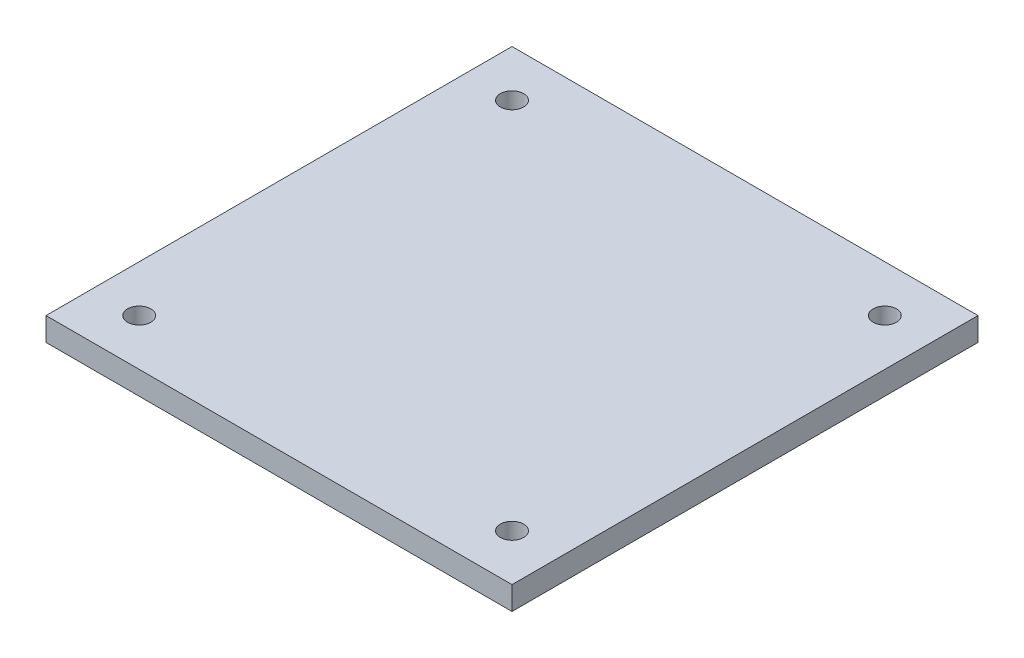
ISO-10303-21;
HEADER;
FILE_DESCRIPTION(('STEP AP214'),'2;1');
FILE_NAME('part.step','',(''),(''),'','','');
FILE_SCHEMA(('AUTOMOTIVE_DESIGN { 1 0 10303 214 1 1 1 1 }'));
ENDSEC;
DATA;
#1=APPLICATION_CONTEXT('core data for automotive mechanical design processes');
#2=APPLICATION_PROTOCOL_DEFINITION('international standard','automotive_design',2000,#1);
#3=PRODUCT_CONTEXT('',#1,'mechanical');
#4=PRODUCT('Part','Part','',(#3));
#5=PRODUCT_RELATED_PRODUCT_CATEGORY('part','',(#4));
#6=PRODUCT_DEFINITION_FORMATION('','',#4);
#7=PRODUCT_DEFINITION_CONTEXT('part definition',#1,'design');
#8=PRODUCT_DEFINITION('design','',#6,#7);
#9=PRODUCT_DEFINITION_SHAPE('','',#8);
#10=(LENGTH_UNIT() NAMED_UNIT(*) SI_UNIT(.MILLI.,.METRE.));
#11=(NAMED_UNIT(*) PLANE_ANGLE_UNIT() SI_UNIT($,.RADIAN.));
#12=(NAMED_UNIT(*) SI_UNIT($,.STERADIAN.) SOLID_ANGLE_UNIT());
#13=UNCERTAINTY_MEASURE_WITH_UNIT(LENGTH_MEASURE(1.E-05),#10,'distance_accuracy_value','');
#14=(GEOMETRIC_REPRESENTATION_CONTEXT(3) GLOBAL_UNCERTAINTY_ASSIGNED_CONTEXT((#13)) GLOBAL_UNIT_ASSIGNED_CONTEXT((#10,
#11,#12)) REPRESENTATION_CONTEXT('',''));
#15=CARTESIAN_POINT('',(0.,0.,0.));
#16=DIRECTION('',(0.,0.,1.));
#17=DIRECTION('',(1.,0.,0.));
#18=AXIS2_PLACEMENT_3D('',#15,#16,#17);
#19=CARTESIAN_POINT('',(50.,5.,-50.));
#20=DIRECTION('',(-1.,0.,0.));
#21=DIRECTION('',(0.,0.,1.));
#22=AXIS2_PLACEMENT_3D('',#19,#20,#21);
#23=PLANE('',#22);
#24=DIRECTION('',(0.,0.,-1.));
#25=VECTOR('',#24,1.);
#26=CARTESIAN_POINT('',(50.,0.,-50.));
#27=LINE('',#26,#25);
#28=CARTESIAN_POINT('',(50.,0.,50.));
#29=VERTEX_POINT('',#28);
#30=CARTESIAN_POINT('',(50.,0.,-50.));
#31=VERTEX_POINT('',#30);
#32=EDGE_CURVE('E99',#29,#31,#27,.T.);
#33=ORIENTED_EDGE('',*,*,#32,.T.);
#34=DIRECTION('',(0.,-1.,0.));
#35=VECTOR('',#34,1.);
#36=CARTESIAN_POINT('',(50.,5.,-50.));
#37=LINE('',#36,#35);
#38=CARTESIAN_POINT('',(50.,5.,-50.));
#39=VERTEX_POINT('',#38);
#40=EDGE_CURVE('E11',#39,#31,#37,.T.);
#41=ORIENTED_EDGE('',*,*,#40,.F.);
#42=DIRECTION('',(0.,0.,-1.));
#43=VECTOR('',#42,1.);
#44=CARTESIAN_POINT('',(50.,5.,-50.));
#45=LINE('',#44,#43);
#46=CARTESIAN_POINT('',(50.,5.,50.));
#47=VERTEX_POINT('',#46);
#48=EDGE_CURVE('E87',#47,#39,#45,.T.);
#49=ORIENTED_EDGE('',*,*,#48,.F.);
#50=DIRECTION('',(0.,-1.,0.));
#51=VECTOR('',#50,1.);
#52=CARTESIAN_POINT('',(50.,5.,50.));
#53=LINE('',#52,#51);
#54=EDGE_CURVE('E95',#47,#29,#53,.T.);
#55=ORIENTED_EDGE('',*,*,#54,.T.);
#56=EDGE_LOOP('',(#33,#41,#49,#55));
#57=FACE_BOUND('',#56,.T.);
#58=ADVANCED_FACE('F36',(#57),#23,.F.);
#59=CARTESIAN_POINT('',(-50.,5.,-50.));
#60=DIRECTION('',(0.,0.,1.));
#61=DIRECTION('',(1.,0.,0.));
#62=AXIS2_PLACEMENT_3D('',#59,#60,#61);
#63=PLANE('',#62);
#64=DIRECTION('',(-1.,0.,0.));
#65=VECTOR('',#64,1.);
#66=CARTESIAN_POINT('',(-50.,0.,-50.));
#67=LINE('',#66,#65);
#68=CARTESIAN_POINT('',(-50.,0.,-50.));
#69=VERTEX_POINT('',#68);
#70=EDGE_CURVE('E91',#31,#69,#67,.T.);
#71=ORIENTED_EDGE('',*,*,#70,.T.);
#72=DIRECTION('',(0.,-1.,0.));
#73=VECTOR('',#72,1.);
#74=CARTESIAN_POINT('',(-50.,5.,-50.));
#75=LINE('',#74,#73);
#76=CARTESIAN_POINT('',(-50.,5.,-50.));
#77=VERTEX_POINT('',#76);
#78=EDGE_CURVE('E44',#77,#69,#75,.T.);
#79=ORIENTED_EDGE('',*,*,#78,.F.);
#80=DIRECTION('',(-1.,0.,0.));
#81=VECTOR('',#80,1.);
#82=CARTESIAN_POINT('',(-50.,5.,-50.));
#83=LINE('',#82,#81);
#84=EDGE_CURVE('E82',#39,#77,#83,.T.);
#85=ORIENTED_EDGE('',*,*,#84,.F.);
#86=ORIENTED_EDGE('',*,*,#40,.T.);
#87=EDGE_LOOP('',(#71,#79,#85,#86));
#88=FACE_BOUND('',#87,.T.);
#89=ADVANCED_FACE('F90',(#88),#63,.F.);
#90=CARTESIAN_POINT('',(-50.,5.,-50.));
#91=DIRECTION('',(1.,0.,0.));
#92=DIRECTION('',(0.,0.,-1.));
#93=AXIS2_PLACEMENT_3D('',#90,#91,#92);
#94=PLANE('',#93);
#95=DIRECTION('',(0.,0.,1.));
#96=VECTOR('',#95,1.);
#97=CARTESIAN_POINT('',(-50.,0.,-50.));
#98=LINE('',#97,#96);
#99=CARTESIAN_POINT('',(-50.,0.,50.));
#100=VERTEX_POINT('',#99);
#101=EDGE_CURVE('E69',#69,#100,#98,.T.);
#102=ORIENTED_EDGE('',*,*,#101,.T.);
#103=DIRECTION('',(0.,-1.,0.));
#104=VECTOR('',#103,1.);
#105=CARTESIAN_POINT('',(-50.,5.,50.));
#106=LINE('',#105,#104);
#107=CARTESIAN_POINT('',(-50.,5.,50.));
#108=VERTEX_POINT('',#107);
#109=EDGE_CURVE('E92',#108,#100,#106,.T.);
#110=ORIENTED_EDGE('',*,*,#109,.F.);
#111=DIRECTION('',(0.,0.,1.));
#112=VECTOR('',#111,1.);
#113=CARTESIAN_POINT('',(-50.,5.,-50.));
#114=LINE('',#113,#112);
#115=EDGE_CURVE('E85',#77,#108,#114,.T.);
#116=ORIENTED_EDGE('',*,*,#115,.F.);
#117=ORIENTED_EDGE('',*,*,#78,.T.);
#118=EDGE_LOOP('',(#102,#110,#116,#117));
#119=FACE_BOUND('',#118,.T.);
#120=ADVANCED_FACE('F93',(#119),#94,.F.);
#121=CARTESIAN_POINT('',(-50.,5.,50.));
#122=DIRECTION('',(0.,0.,-1.));
#123=DIRECTION('',(-1.,0.,0.));
#124=AXIS2_PLACEMENT_3D('',#121,#122,#123);
#125=PLANE('',#124);
#126=DIRECTION('',(1.,0.,0.));
#127=VECTOR('',#126,1.);
#128=CARTESIAN_POINT('',(-50.,0.,50.));
#129=LINE('',#128,#127);
#130=EDGE_CURVE('E75',#100,#29,#129,.T.);
#131=ORIENTED_EDGE('',*,*,#130,.T.);
#132=ORIENTED_EDGE('',*,*,#54,.F.);
#133=DIRECTION('',(1.,0.,0.));
#134=VECTOR('',#133,1.);
#135=CARTESIAN_POINT('',(-50.,5.,50.));
#136=LINE('',#135,#134);
#137=EDGE_CURVE('E52',#108,#47,#136,.T.);
#138=ORIENTED_EDGE('',*,*,#137,.F.);
#139=ORIENTED_EDGE('',*,*,#109,.T.);
#140=EDGE_LOOP('',(#131,#132,#138,#139));
#141=FACE_BOUND('',#140,.T.);
#142=ADVANCED_FACE('F107',(#141),#125,.F.);
#143=CARTESIAN_POINT('',(0.,5.,0.));
#144=DIRECTION('',(0.,1.,0.));
#145=DIRECTION('',(0.,0.,1.));
#146=AXIS2_PLACEMENT_3D('',#143,#144,#145);
#147=PLANE('',#146);
#148=CARTESIAN_POINT('',(-40.,5.,-40.));
#149=DIRECTION('',(0.,1.,0.));
#150=DIRECTION('',(0.,0.,1.));
#151=AXIS2_PLACEMENT_3D('',#148,#149,#150);
#152=CIRCLE('',#151,2.49999999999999);
#153=CARTESIAN_POINT('',(-40.,5.,-37.5));
#154=VERTEX_POINT('',#153);
#155=EDGE_CURVE('E142',#154,#154,#152,.T.);
#156=ORIENTED_EDGE('',*,*,#155,.F.);
#157=EDGE_LOOP('',(#156));
#158=FACE_BOUND('',#157,.T.);
#159=CARTESIAN_POINT('',(-40.,5.,40.));
#160=DIRECTION('',(0.,1.,0.));
#161=DIRECTION('',(0.,0.,1.));
#162=AXIS2_PLACEMENT_3D('',#159,#160,#161);
#163=CIRCLE('',#162,2.49999999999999);
#164=CARTESIAN_POINT('',(-40.,5.,42.5));
#165=VERTEX_POINT('',#164);
#166=EDGE_CURVE('E133',#165,#165,#163,.T.);
#167=ORIENTED_EDGE('',*,*,#166,.F.);
#168=EDGE_LOOP('',(#167));
#169=FACE_BOUND('',#168,.T.);
#170=CARTESIAN_POINT('',(40.,5.,-40.));
#171=DIRECTION('',(0.,1.,0.));
#172=DIRECTION('',(0.,0.,1.));
#173=AXIS2_PLACEMENT_3D('',#170,#171,#172);
#174=CIRCLE('',#173,2.49999999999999);
#175=CARTESIAN_POINT('',(40.,5.,-37.5));
#176=VERTEX_POINT('',#175);
#177=EDGE_CURVE('E124',#176,#176,#174,.T.);
#178=ORIENTED_EDGE('',*,*,#177,.F.);
#179=EDGE_LOOP('',(#178));
#180=FACE_BOUND('',#179,.T.);
#181=CARTESIAN_POINT('',(40.,5.,40.));
#182=DIRECTION('',(0.,1.,0.));
#183=DIRECTION('',(0.,0.,1.));
#184=AXIS2_PLACEMENT_3D('',#181,#182,#183);
#185=CIRCLE('',#184,2.49999999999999);
#186=CARTESIAN_POINT('',(40.,5.,42.5));
#187=VERTEX_POINT('',#186);
#188=EDGE_CURVE('E115',#187,#187,#185,.T.);
#189=ORIENTED_EDGE('',*,*,#188,.F.);
#190=EDGE_LOOP('',(#189));
#191=FACE_BOUND('',#190,.T.);
#192=ORIENTED_EDGE('',*,*,#48,.T.);
#193=ORIENTED_EDGE('',*,*,#84,.T.);
#194=ORIENTED_EDGE('',*,*,#115,.T.);
#195=ORIENTED_EDGE('',*,*,#137,.T.);
#196=EDGE_LOOP('',(#192,#193,#194,#195));
#197=FACE_BOUND('',#196,.T.);
#198=ADVANCED_FACE('F83',(#158,#169,#180,#191,#197),#147,.T.);
#199=CARTESIAN_POINT('',(0.,0.,0.));
#200=DIRECTION('',(0.,1.,0.));
#201=DIRECTION('',(0.,0.,1.));
#202=AXIS2_PLACEMENT_3D('',#199,#200,#201);
#203=PLANE('',#202);
#204=CARTESIAN_POINT('',(-40.,0.,-40.));
#205=DIRECTION('',(0.,1.,0.));
#206=DIRECTION('',(0.,0.,1.));
#207=AXIS2_PLACEMENT_3D('',#204,#205,#206);
#208=CIRCLE('',#207,2.525);
#209=CARTESIAN_POINT('',(-40.,0.,-37.475));
#210=VERTEX_POINT('',#209);
#211=EDGE_CURVE('E145',#210,#210,#208,.T.);
#212=ORIENTED_EDGE('',*,*,#211,.T.);
#213=EDGE_LOOP('',(#212));
#214=FACE_BOUND('',#213,.T.);
#215=CARTESIAN_POINT('',(-40.,0.,40.));
#216=DIRECTION('',(0.,1.,0.));
#217=DIRECTION('',(0.,0.,1.));
#218=AXIS2_PLACEMENT_3D('',#215,#216,#217);
#219=CIRCLE('',#218,2.525);
#220=CARTESIAN_POINT('',(-40.,0.,42.525));
#221=VERTEX_POINT('',#220);
#222=EDGE_CURVE('E136',#221,#221,#219,.T.);
#223=ORIENTED_EDGE('',*,*,#222,.T.);
#224=EDGE_LOOP('',(#223));
#225=FACE_BOUND('',#224,.T.);
#226=CARTESIAN_POINT('',(40.,0.,-40.));
#227=DIRECTION('',(0.,1.,0.));
#228=DIRECTION('',(0.,0.,1.));
#229=AXIS2_PLACEMENT_3D('',#226,#227,#228);
#230=CIRCLE('',#229,2.525);
#231=CARTESIAN_POINT('',(40.,0.,-37.475));
#232=VERTEX_POINT('',#231);
#233=EDGE_CURVE('E127',#232,#232,#230,.T.);
#234=ORIENTED_EDGE('',*,*,#233,.T.);
#235=EDGE_LOOP('',(#234));
#236=FACE_BOUND('',#235,.T.);
#237=CARTESIAN_POINT('',(40.,0.,40.));
#238=DIRECTION('',(0.,1.,0.));
#239=DIRECTION('',(0.,0.,1.));
#240=AXIS2_PLACEMENT_3D('',#237,#238,#239);
#241=CIRCLE('',#240,2.525);
#242=CARTESIAN_POINT('',(40.,0.,42.525));
#243=VERTEX_POINT('',#242);
#244=EDGE_CURVE('E118',#243,#243,#241,.T.);
#245=ORIENTED_EDGE('',*,*,#244,.T.);
#246=EDGE_LOOP('',(#245));
#247=FACE_BOUND('',#246,.T.);
#248=ORIENTED_EDGE('',*,*,#32,.F.);
#249=ORIENTED_EDGE('',*,*,#130,.F.);
#250=ORIENTED_EDGE('',*,*,#101,.F.);
#251=ORIENTED_EDGE('',*,*,#70,.F.);
#252=EDGE_LOOP('',(#248,#249,#250,#251));
#253=FACE_BOUND('',#252,.T.);
#254=ADVANCED_FACE('F110',(#214,#225,#236,#247,#253),#203,.F.);
#255=CARTESIAN_POINT('',(40.,0.0249999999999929,40.));
#256=DIRECTION('',(0.,-1.,0.));
#257=DIRECTION('',(0.,0.,-1.));
#258=AXIS2_PLACEMENT_3D('',#255,#256,#257);
#259=CONICAL_SURFACE('',#258,2.49999999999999,0.785398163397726);
#260=ORIENTED_EDGE('',*,*,#244,.F.);
#261=EDGE_LOOP('',(#260));
#262=FACE_BOUND('',#261,.T.);
#263=CARTESIAN_POINT('',(40.,0.0249999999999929,40.));
#264=DIRECTION('',(0.,1.,0.));
#265=DIRECTION('',(0.,0.,1.));
#266=AXIS2_PLACEMENT_3D('',#263,#264,#265);
#267=CIRCLE('',#266,2.49999999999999);
#268=CARTESIAN_POINT('',(40.,0.0249999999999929,42.5));
#269=VERTEX_POINT('',#268);
#270=EDGE_CURVE('E102',#269,#269,#267,.T.);
#271=ORIENTED_EDGE('',*,*,#270,.T.);
#272=EDGE_LOOP('',(#271));
#273=FACE_BOUND('',#272,.T.);
#274=ADVANCED_FACE('F176',(#262,#273),#259,.F.);
#275=CARTESIAN_POINT('',(40.,5.,40.));
#276=DIRECTION('',(0.,1.,0.));
#277=DIRECTION('',(0.,0.,1.));
#278=AXIS2_PLACEMENT_3D('',#275,#276,#277);
#279=CYLINDRICAL_SURFACE('',#278,2.49999999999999);
#280=ORIENTED_EDGE('',*,*,#270,.F.);
#281=EDGE_LOOP('',(#280));
#282=FACE_BOUND('',#281,.T.);
#283=ORIENTED_EDGE('',*,*,#188,.T.);
#284=EDGE_LOOP('',(#283));
#285=FACE_BOUND('',#284,.T.);
#286=ADVANCED_FACE('F173',(#282,#285),#279,.F.);
#287=CARTESIAN_POINT('',(40.,0.0249999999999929,-40.));
#288=DIRECTION('',(0.,-1.,0.));
#289=DIRECTION('',(0.,0.,-1.));
#290=AXIS2_PLACEMENT_3D('',#287,#288,#289);
#291=CONICAL_SURFACE('',#290,2.49999999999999,0.785398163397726);
#292=ORIENTED_EDGE('',*,*,#233,.F.);
#293=EDGE_LOOP('',(#292));
#294=FACE_BOUND('',#293,.T.);
#295=CARTESIAN_POINT('',(40.,0.0249999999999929,-40.));
#296=DIRECTION('',(0.,1.,0.));
#297=DIRECTION('',(0.,0.,1.));
#298=AXIS2_PLACEMENT_3D('',#295,#296,#297);
#299=CIRCLE('',#298,2.49999999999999);
#300=CARTESIAN_POINT('',(40.,0.0249999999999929,-37.5));
#301=VERTEX_POINT('',#300);
#302=EDGE_CURVE('E121',#301,#301,#299,.T.);
#303=ORIENTED_EDGE('',*,*,#302,.T.);
#304=EDGE_LOOP('',(#303));
#305=FACE_BOUND('',#304,.T.);
#306=ADVANCED_FACE('F175',(#294,#305),#291,.F.);
#307=CARTESIAN_POINT('',(40.,5.,-40.));
#308=DIRECTION('',(0.,1.,0.));
#309=DIRECTION('',(0.,0.,1.));
#310=AXIS2_PLACEMENT_3D('',#307,#308,#309);
#311=CYLINDRICAL_SURFACE('',#310,2.49999999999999);
#312=ORIENTED_EDGE('',*,*,#302,.F.);
#313=EDGE_LOOP('',(#312));
#314=FACE_BOUND('',#313,.T.);
#315=ORIENTED_EDGE('',*,*,#177,.T.);
#316=EDGE_LOOP('',(#315));
#317=FACE_BOUND('',#316,.T.);
#318=ADVANCED_FACE('F183',(#314,#317),#311,.F.);
#319=CARTESIAN_POINT('',(-40.,0.0249999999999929,40.));
#320=DIRECTION('',(0.,-1.,0.));
#321=DIRECTION('',(0.,0.,-1.));
#322=AXIS2_PLACEMENT_3D('',#319,#320,#321);
#323=CONICAL_SURFACE('',#322,2.49999999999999,0.785398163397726);
#324=ORIENTED_EDGE('',*,*,#222,.F.);
#325=EDGE_LOOP('',(#324));
#326=FACE_BOUND('',#325,.T.);
#327=CARTESIAN_POINT('',(-40.,0.0249999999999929,40.));
#328=DIRECTION('',(0.,1.,0.));
#329=DIRECTION('',(0.,0.,1.));
#330=AXIS2_PLACEMENT_3D('',#327,#328,#329);
#331=CIRCLE('',#330,2.49999999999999);
#332=CARTESIAN_POINT('',(-40.,0.0249999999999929,42.5));
#333=VERTEX_POINT('',#332);
#334=EDGE_CURVE('E130',#333,#333,#331,.T.);
#335=ORIENTED_EDGE('',*,*,#334,.T.);
#336=EDGE_LOOP('',(#335));
#337=FACE_BOUND('',#336,.T.);
#338=ADVANCED_FACE('F254',(#326,#337),#323,.F.);
#339=CARTESIAN_POINT('',(-40.,5.,40.));
#340=DIRECTION('',(0.,1.,0.));
#341=DIRECTION('',(0.,0.,1.));
#342=AXIS2_PLACEMENT_3D('',#339,#340,#341);
#343=CYLINDRICAL_SURFACE('',#342,2.49999999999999);
#344=ORIENTED_EDGE('',*,*,#334,.F.);
#345=EDGE_LOOP('',(#344));
#346=FACE_BOUND('',#345,.T.);
#347=ORIENTED_EDGE('',*,*,#166,.T.);
#348=EDGE_LOOP('',(#347));
#349=FACE_BOUND('',#348,.T.);
#350=ADVANCED_FACE('F155',(#346,#349),#343,.F.);
#351=CARTESIAN_POINT('',(-40.,0.0249999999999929,-40.));
#352=DIRECTION('',(0.,-1.,0.));
#353=DIRECTION('',(0.,0.,-1.));
#354=AXIS2_PLACEMENT_3D('',#351,#352,#353);
#355=CONICAL_SURFACE('',#354,2.49999999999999,0.785398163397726);
#356=ORIENTED_EDGE('',*,*,#211,.F.);
#357=EDGE_LOOP('',(#356));
#358=FACE_BOUND('',#357,.T.);
#359=CARTESIAN_POINT('',(-40.,0.0249999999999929,-40.));
#360=DIRECTION('',(0.,1.,0.));
#361=DIRECTION('',(0.,0.,1.));
#362=AXIS2_PLACEMENT_3D('',#359,#360,#361);
#363=CIRCLE('',#362,2.49999999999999);
#364=CARTESIAN_POINT('',(-40.,0.0249999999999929,-37.5));
#365=VERTEX_POINT('',#364);
#366=EDGE_CURVE('E139',#365,#365,#363,.T.);
#367=ORIENTED_EDGE('',*,*,#366,.T.);
#368=EDGE_LOOP('',(#367));
#369=FACE_BOUND('',#368,.T.);
#370=ADVANCED_FACE('F151',(#358,#369),#355,.F.);
#371=CARTESIAN_POINT('',(-40.,5.,-40.));
#372=DIRECTION('',(0.,1.,0.));
#373=DIRECTION('',(0.,0.,1.));
#374=AXIS2_PLACEMENT_3D('',#371,#372,#373);
#375=CYLINDRICAL_SURFACE('',#374,2.49999999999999);
#376=ORIENTED_EDGE('',*,*,#366,.F.);
#377=EDGE_LOOP('',(#376));
#378=FACE_BOUND('',#377,.T.);
#379=ORIENTED_EDGE('',*,*,#155,.T.);
#380=EDGE_LOOP('',(#379));
#381=FACE_BOUND('',#380,.T.);
#382=ADVANCED_FACE('F154',(#378,#381),#375,.F.);
#383=CLOSED_SHELL('',(#58,#89,#120,#142,#198,#254,#274,#286,#306,#318,#338,#350,#370,#382));
#384=MANIFOLD_SOLID_BREP('B2',#383);
#385=ADVANCED_BREP_SHAPE_REPRESENTATION('',(#18,#384),#14);
#386=SHAPE_DEFINITION_REPRESENTATION(#9,#385);
ENDSEC;
END-ISO-10303-21;
